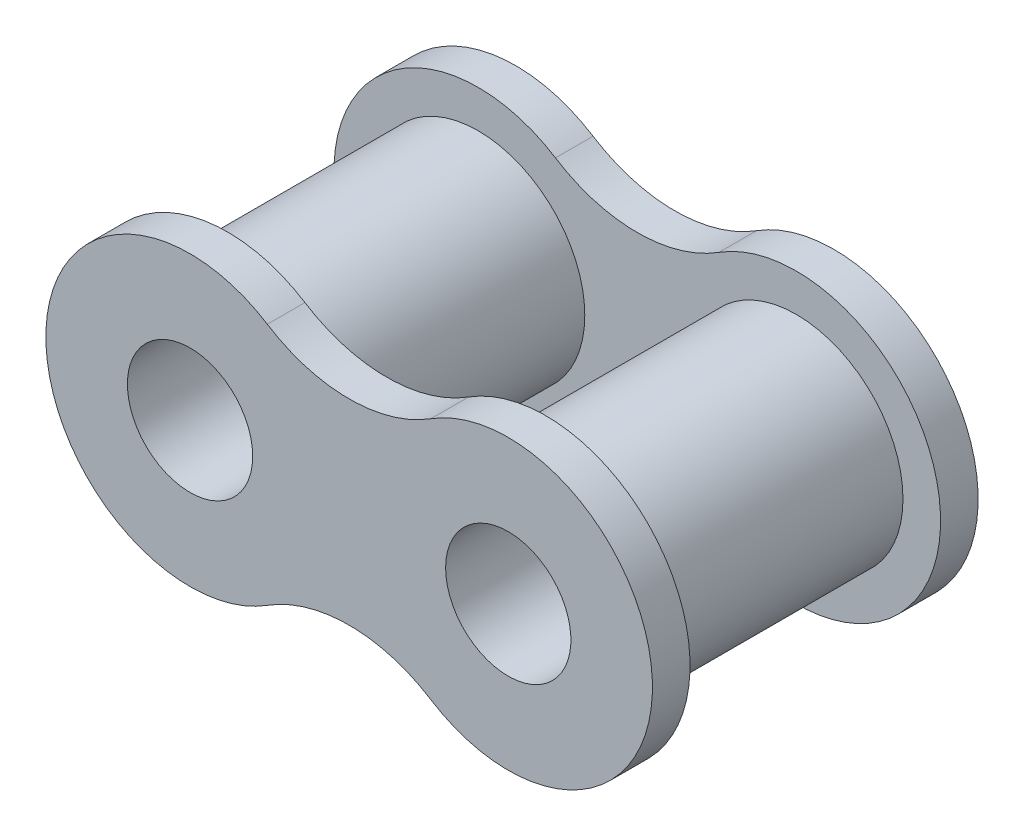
from build123d import *

# Parameters (mm, degrees)
SKETCH1_R               = 4.255
BOSS_EXTRUDE3_DEPTH     = 5
BOSS_EXTRUDE3_2_DEPTH   = 5
BOSS_EXTRUDE7_START     = -5
BOSS_EXTRUDE7_DEPTH     = 1.5
CUT_EXTRUDE1_DEPTH      = 15.896343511
CUT_EXTRUDE1_DEPTH_BACK = 15.896343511
SKETCH2_R               = 2.5


with BuildPart() as part:
    # Sketch1 → Boss-Extrude3 (new, symmetric)
    with BuildSketch(Plane.XY):
        with Locations((6.35, 0)):
            Circle(SKETCH1_R)
    extrude(amount=BOSS_EXTRUDE3_DEPTH, both=True)



with BuildPart() as body_2:
    # Sketch1 → Boss-Extrude3 2 (new, symmetric)
    with BuildSketch(Plane.XY):
        with Locations((-6.35, 0)):
            Circle(SKETCH1_R)
    extrude(amount=BOSS_EXTRUDE3_2_DEPTH, both=True)


with BuildPart() as part_1:
    add(part.part)

    add(body_2.part)  # Boss-Extrude7 merges body 2
    # Sketch1_5 → Boss-Extrude7 (add)
    with BuildSketch(Plane.XY.offset(BOSS_EXTRUDE7_START)):
        with BuildLine():
            ThreePointArc((-3.26499838, 4.858270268), (-12.105, 0), (-3.26499838, -4.858270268))
            ThreePointArc((-3.26499838, -4.858270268), (0, -3.909220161), (3.26499838, -4.858270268))
            ThreePointArc((3.26499838, -4.858270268), (12.105, 0), (3.26499838, 4.858270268))
            ThreePointArc((3.26499838, 4.858270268), (0, 3.909220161), (-3.26499838, 4.858270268))
        make_face()
    boss_extrude7 = extrude(amount=-BOSS_EXTRUDE7_DEPTH)

    # Mirror1: Boss-Extrude7 across plane
    add(boss_extrude7.mirror(Plane.XY))

    # Sketch2 → Cut-Extrude1 (cut, two sides: drawn at the far end of the back side and taken through both)
    with BuildSketch(Plane.XY.offset(-CUT_EXTRUDE1_DEPTH_BACK)):
        with Locations((-6.35, 0)):
            Circle(SKETCH2_R)
        with Locations(Location((6.35, 0, 0), (0, 0, 180))):
            Circle(SKETCH2_R)
    extrude(amount=CUT_EXTRUDE1_DEPTH + CUT_EXTRUDE1_DEPTH_BACK, mode=Mode.SUBTRACT)


solid = part_1.part
